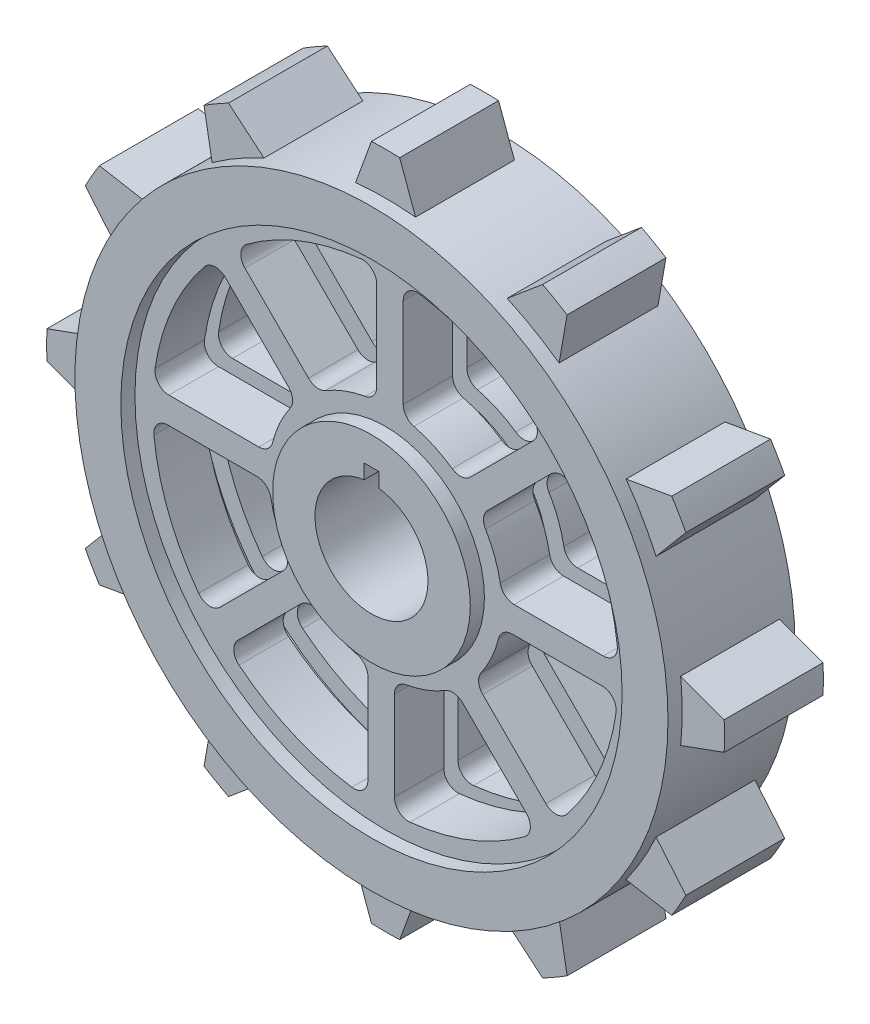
from build123d import *

# Parameters (mm, degrees)
SKETCH3_R                = 21
BOSS_EXTRUDE2_DEPTH      = 4.5
CUT_EXTRUDE1_DEPTH       = 32.032241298
SKETCH5_R                = 17.75
SKETCH5_R_2              = 7
CUT_EXTRUDE5_DEPTH       = 1
SKETCH6_R                = 17.75
SKETCH6_R_2              = 7
CUT_EXTRUDE6_DEPTH       = 1
CUT_EXTRUDE7_DEPTH       = 31.757112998
FILLET1_R                = 1
CIRPATTERN1_COUNT        = 8
FILLET1_OF_CIRPATTERN1_R = 1
BOSS_EXTRUDE3_DEPTH      = 7
CIRPATTERN2_COUNT        = 12


with BuildPart() as part:
    # Sketch3 → Boss-Extrude2 (new, symmetric)
    with BuildSketch(Plane.XY):
        Circle(SKETCH3_R)
    extrude(amount=BOSS_EXTRUDE2_DEPTH, both=True)

    # Sketch4 → Cut-Extrude1 (cut, through all)
    with BuildSketch(Plane.XY.offset(4.5)):
        with BuildLine():
            Line((-0.525, 5), (-0.525, 3.965397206))
            ThreePointArc((-0.525, 3.965397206), (0, -4), (0.525, 3.965397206))
            Line((0.525, 3.965397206), (0.525, 5))
            Line((0.525, 5), (-0.525, 5))
        make_face()
    extrude(amount=-CUT_EXTRUDE1_DEPTH, mode=Mode.SUBTRACT)

    # Sketch5 → Cut-Extrude5 (cut)
    with BuildSketch(Plane.XY):
        Circle(SKETCH5_R)
        Circle(SKETCH5_R_2, mode=Mode.SUBTRACT)
    extrude(amount=-CUT_EXTRUDE5_DEPTH, mode=Mode.SUBTRACT)

    # Sketch6 → Cut-Extrude6 (cut)
    with BuildSketch(Plane.XY.offset(4.5)):
        Circle(SKETCH6_R)
        Circle(SKETCH6_R_2, mode=Mode.SUBTRACT)
    cut_extrude6 = extrude(amount=-CUT_EXTRUDE6_DEPTH, mode=Mode.SUBTRACT)

    # Mirror2: Cut-Extrude6 across plane
    add(cut_extrude6.mirror(Plane.XY), mode=Mode.SUBTRACT)

    # Sketch7 → Cut-Extrude7 (cut, through all)
    with BuildSketch(Plane.XY.offset(3.5)):
        with BuildLine():
            ThreePointArc((11.216947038, 12.100830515), (6.602320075, 15.121487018), (1.25, 16.452583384))
            Line((1.25, 16.452583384), (1.25, 8.154753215))
            ThreePointArc((1.25, 8.154753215), (3.445440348, 7.496095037), (5.374924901, 6.258808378))
            Line((5.374924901, 6.258808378), (11.216947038, 12.100830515))
        make_face()
    cut_extrude7 = extrude(amount=-CUT_EXTRUDE7_DEPTH, mode=Mode.SUBTRACT)

    # Fillet1
    fillet1_edges = [part.edges().sort_by_distance(p)[0] for p in [
        (11.216947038, 12.100830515, 1.75),
        (5.374924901, 6.258808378, 1.75),
        (1.25, 8.154753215, 1.75),
        (1.25, 16.452583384, 1.75),
        (11.216947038, 12.100830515, -2.25),
        (5.374924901, 6.258808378, -2.25),
        (1.25, 8.154753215, -2.25),
        (1.25, 16.452583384, -2.25),
    ]]
    fillet(fillet1_edges, radius=FILLET1_R)

    # CirPattern1: Cut-Extrude7 ×8 about axis
    cirpattern1_axis = Axis((0, 0, 0), (0, 0, 1))
    for i in range(1, CIRPATTERN1_COUNT):
        add(cut_extrude7.rotate(cirpattern1_axis, i * 360 / CIRPATTERN1_COUNT), mode=Mode.SUBTRACT)

    # Fillet1 of CirPattern1
    fillet1_of_cirpattern1_edges = [part.edges().sort_by_distance(p)[0] for p in [
        (-0.625, 16.48815863, 1.75),
        (-0.625, 8.226291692, 1.75),
        (-4.882397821, 6.650164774, 1.75),
        (-10.749849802, 12.517616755, 1.75),
        (-0.625, 16.48815863, -2.25),
        (-0.625, 8.226291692, -2.25),
        (-4.882397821, 6.650164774, -2.25),
        (-10.749849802, 12.517616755, -2.25),
        (-12.100830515, 11.216947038, 1.75),
        (-6.258808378, 5.374924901, 1.75),
        (-8.154753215, 1.25, 1.75),
        (-16.452583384, 1.25, 1.75),
        (-12.100830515, 11.216947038, -2.25),
        (-6.258808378, 5.374924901, -2.25),
        (-8.154753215, 1.25, -2.25),
        (-16.452583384, 1.25, -2.25),
        (-16.48815863, -0.625, 1.75),
        (-8.226291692, -0.625, 1.75),
        (-6.650164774, -4.882397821, 1.75),
        (-12.517616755, -10.749849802, 1.75),
        (-16.48815863, -0.625, -2.25),
        (-8.226291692, -0.625, -2.25),
        (-6.650164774, -4.882397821, -2.25),
        (-12.517616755, -10.749849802, -2.25),
        (-11.216947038, -12.100830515, 1.75),
        (-5.374924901, -6.258808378, 1.75),
        (-1.25, -8.154753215, 1.75),
        (-1.25, -16.452583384, 1.75),
        (-11.216947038, -12.100830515, -2.25),
        (-5.374924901, -6.258808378, -2.25),
        (-1.25, -8.154753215, -2.25),
        (-1.25, -16.452583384, -2.25),
        (0.625, -16.48815863, 1.75),
        (0.625, -8.226291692, 1.75),
        (4.882397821, -6.650164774, 1.75),
        (10.749849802, -12.517616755, 1.75),
        (0.625, -16.48815863, -2.25),
        (0.625, -8.226291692, -2.25),
        (4.882397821, -6.650164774, -2.25),
        (10.749849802, -12.517616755, -2.25),
        (12.100830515, -11.216947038, 1.75),
        (6.258808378, -5.374924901, 1.75),
        (8.154753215, -1.25, 1.75),
        (16.452583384, -1.25, 1.75),
        (12.100830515, -11.216947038, -2.25),
        (6.258808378, -5.374924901, -2.25),
        (8.154753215, -1.25, -2.25),
        (16.452583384, -1.25, -2.25),
        (16.48815863, 0.625, 1.75),
        (8.226291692, 0.625, 1.75),
        (6.650164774, 4.882397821, 1.75),
        (12.517616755, 10.749849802, 1.75),
        (16.48815863, 0.625, -2.25),
        (8.226291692, 0.625, -2.25),
        (6.650164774, 4.882397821, -2.25),
        (12.517616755, 10.749849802, -2.25),
    ]]
    fillet(fillet1_of_cirpattern1_edges, radius=FILLET1_OF_CIRPATTERN1_R)

    # Sketch8 → Boss-Extrude3 (add)
    with BuildSketch(Plane.XY.offset(3.5)):
        with BuildLine():
            Line((-1, 23.979157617), (-2.123502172, 20.89236077))
            ThreePointArc((-2.123502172, 20.89236077), (0, 21), (2.123502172, 20.89236077))
            Line((2.123502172, 20.89236077), (1, 23.979157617))
            ThreePointArc((1, 23.979157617), (0, 24), (-1, 23.979157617))
        make_face()
    boss_extrude3 = extrude(amount=-BOSS_EXTRUDE3_DEPTH)

    # CirPattern2: Boss-Extrude3 ×12 about axis
    cirpattern2_axis = Axis((0, 0, 0), (0, 0, 1))
    for i in range(1, CIRPATTERN2_COUNT):
        add(boss_extrude3.rotate(cirpattern2_axis, i * 360 / CIRPATTERN2_COUNT))


solid = part.part
